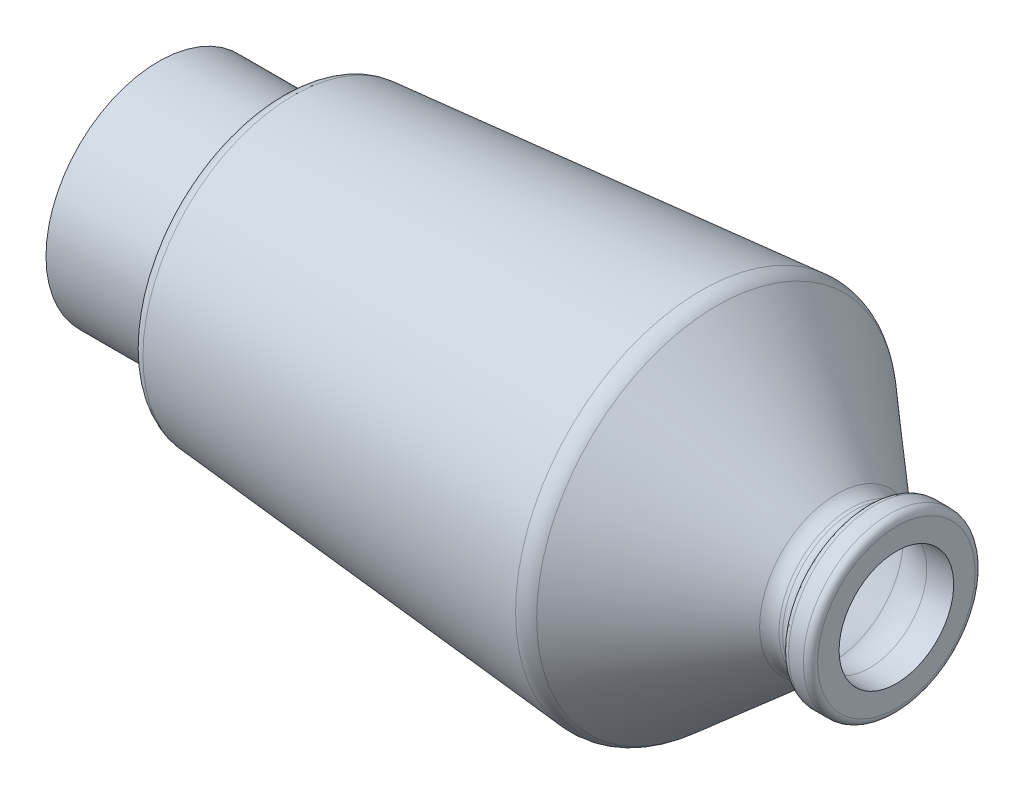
from build123d import *


with BuildPart() as part:
    # Sketch1 → Revolve1 (revolve)
    with BuildSketch(Plane.XY, mode=Mode.PRIVATE) as revolve1_sk:
        with BuildLine():
            Line((0, 7.85), (7.5, 7.85))
            ThreePointArc((7.5, 7.85), (8.207106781, 8.142893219), (8.5, 8.85))
            Line((8.5, 8.85), (8.5, 9.503673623))
            ThreePointArc((8.5, 9.503673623), (8.763237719, 10.179825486), (9.414362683, 10.5))
            Line((9.414362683, 10.5), (37.868765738, 12.945743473))
            ThreePointArc((37.868765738, 12.945743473), (38.460380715, 12.87795771), (38.979001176, 12.585321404))
            Line((38.979001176, 12.585321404), (47.318220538, 5.365932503))
            ThreePointArc((47.318220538, 5.365932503), (47.776120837, 5.094457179), (48.3, 5))
            Line((48.3, 5), (48.557190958, 5))
            ThreePointArc((48.557190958, 5), (49.134541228, 5.183503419), (49.5, 5.666666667))
            ThreePointArc((49.5, 5.666666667), (49.682729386, 5.90824829), (49.971404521, 6))
            Line((49.971404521, 6), (51, 6))
            ThreePointArc((51, 6), (51.353553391, 5.853553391), (51.5, 5.5))
            Line((51.5, 5.5), (51.5, 4))
            Line((51.5, 4), (49.62300461, 4))
            ThreePointArc((49.62300461, 4), (48.225993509, 4.25188581), (47.004926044, 4.975820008))
            Line((47.004926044, 4.975820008), (38.651741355, 12.207298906))
            ThreePointArc((38.651741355, 12.207298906), (38.305994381, 12.402389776), (37.911584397, 12.447580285))
            Line((37.911584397, 12.447580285), (9.457181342, 10.001836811))
            ThreePointArc((9.457181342, 10.001836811), (9.13161886, 9.841749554), (9, 9.503673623))
            Line((9, 9.503673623), (9, 8.85))
            ThreePointArc((9, 8.85), (8.560660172, 7.789339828), (7.5, 7.35))
            Line((7.5, 7.35), (0, 7.35))
            Line((0, 7.35), (0, 7.85))
        make_face()
    revolve(revolve1_sk.sketch.rotate(Axis((0, 0, 0), (1, 0, 0)), 90), axis=Axis((0, 0, 0), (1, 0, 0)))


solid = part.part
